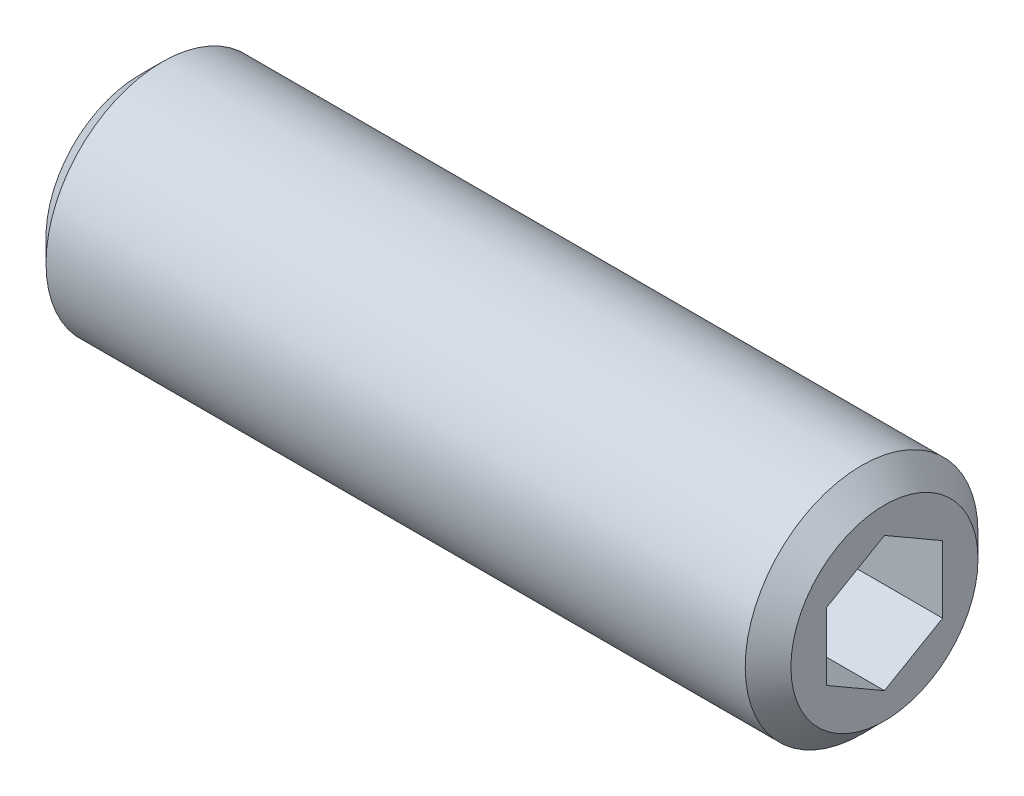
ISO-10303-21;
HEADER;
FILE_DESCRIPTION(('STEP AP214'),'2;1');
FILE_NAME('part.step','',(''),(''),'','','');
FILE_SCHEMA(('AUTOMOTIVE_DESIGN { 1 0 10303 214 1 1 1 1 }'));
ENDSEC;
DATA;
#1=APPLICATION_CONTEXT('core data for automotive mechanical design processes');
#2=APPLICATION_PROTOCOL_DEFINITION('international standard','automotive_design',2000,#1);
#3=PRODUCT_CONTEXT('',#1,'mechanical');
#4=PRODUCT('Part','Part','',(#3));
#5=PRODUCT_RELATED_PRODUCT_CATEGORY('part','',(#4));
#6=PRODUCT_DEFINITION_FORMATION('','',#4);
#7=PRODUCT_DEFINITION_CONTEXT('part definition',#1,'design');
#8=PRODUCT_DEFINITION('design','',#6,#7);
#9=PRODUCT_DEFINITION_SHAPE('','',#8);
#10=(LENGTH_UNIT() NAMED_UNIT(*) SI_UNIT(.MILLI.,.METRE.));
#11=(NAMED_UNIT(*) PLANE_ANGLE_UNIT() SI_UNIT($,.RADIAN.));
#12=(NAMED_UNIT(*) SI_UNIT($,.STERADIAN.) SOLID_ANGLE_UNIT());
#13=UNCERTAINTY_MEASURE_WITH_UNIT(LENGTH_MEASURE(1.E-05),#10,'distance_accuracy_value','');
#14=(GEOMETRIC_REPRESENTATION_CONTEXT(3) GLOBAL_UNCERTAINTY_ASSIGNED_CONTEXT((#13)) GLOBAL_UNIT_ASSIGNED_CONTEXT((#10,
#11,#12)) REPRESENTATION_CONTEXT('',''));
#15=CARTESIAN_POINT('',(0.,0.,0.));
#16=DIRECTION('',(0.,0.,1.));
#17=DIRECTION('',(1.,0.,0.));
#18=AXIS2_PLACEMENT_3D('',#15,#16,#17);
#19=CARTESIAN_POINT('',(16.,-0.721687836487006,-1.25000000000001));
#20=DIRECTION('',(0.,0.,-1.));
#21=DIRECTION('',(-1.,0.,0.));
#22=AXIS2_PLACEMENT_3D('',#19,#20,#21);
#23=PLANE('',#22);
#24=DIRECTION('',(1.,0.,0.));
#25=VECTOR('',#24,1.);
#26=CARTESIAN_POINT('',(16.,-0.72168783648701,-1.25000000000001));
#27=LINE('',#26,#25);
#28=CARTESIAN_POINT('',(13.0000000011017,-0.721687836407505,-1.24999999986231));
#29=VERTEX_POINT('',#28);
#30=CARTESIAN_POINT('',(16.,-0.721687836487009,-1.25000000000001));
#31=VERTEX_POINT('',#30);
#32=EDGE_CURVE('E80',#29,#31,#27,.T.);
#33=ORIENTED_EDGE('',*,*,#32,.T.);
#34=DIRECTION('',(0.,1.,0.));
#35=VECTOR('',#34,1.);
#36=CARTESIAN_POINT('',(16.,-0.721687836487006,-1.25000000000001));
#37=LINE('',#36,#35);
#38=CARTESIAN_POINT('',(16.,0.721687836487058,-1.24999999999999));
#39=VERTEX_POINT('',#38);
#40=EDGE_CURVE('E86',#39,#31,#37,.F.);
#41=ORIENTED_EDGE('',*,*,#40,.F.);
#42=DIRECTION('',(1.,0.,0.));
#43=VECTOR('',#42,1.);
#44=CARTESIAN_POINT('',(16.,0.721687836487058,-1.24999999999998));
#45=LINE('',#44,#43);
#46=CARTESIAN_POINT('',(13.0000000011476,0.721687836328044,-1.25));
#47=VERTEX_POINT('',#46);
#48=EDGE_CURVE('E83',#39,#47,#45,.F.);
#49=ORIENTED_EDGE('',*,*,#48,.T.);
#50=CARTESIAN_POINT('',(13.0000000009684,-0.721687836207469,-1.25000000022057));
#51=CARTESIAN_POINT('',(12.981684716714,-0.658260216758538,-1.25000000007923));
#52=CARTESIAN_POINT('',(12.9650279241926,-0.594285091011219,-1.25000000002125));
#53=CARTESIAN_POINT('',(12.9359539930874,-0.465227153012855,-1.24999999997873));
#54=CARTESIAN_POINT('',(12.923547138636,-0.400142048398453,-1.24999999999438));
#55=CARTESIAN_POINT('',(12.9042349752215,-0.270778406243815,-1.25000000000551));
#56=CARTESIAN_POINT('',(12.8972011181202,-0.206519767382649,-1.25000000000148));
#57=CARTESIAN_POINT('',(12.888805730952,-0.0777002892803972,-1.24999999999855));
#58=CARTESIAN_POINT('',(12.8874372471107,-0.0131399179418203,-1.24999999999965));
#59=CARTESIAN_POINT('',(12.8902914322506,0.107484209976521,-1.25000000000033));
#60=CARTESIAN_POINT('',(12.8938133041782,0.163566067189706,-1.2500000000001));
#61=CARTESIAN_POINT('',(12.904973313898,0.275364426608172,-1.24999999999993));
#62=CARTESIAN_POINT('',(12.9126152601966,0.331080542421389,-1.24999999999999));
#63=CARTESIAN_POINT('',(12.9317186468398,0.443109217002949,-1.25000000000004));
#64=CARTESIAN_POINT('',(12.9432610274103,0.499407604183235,-1.25000000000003));
#65=CARTESIAN_POINT('',(12.9694573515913,0.611164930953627,-1.25));
#66=CARTESIAN_POINT('',(12.984105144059,0.666625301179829,-1.24999999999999));
#67=CARTESIAN_POINT('',(13.0000000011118,0.721687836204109,-1.25000000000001));
#68=B_SPLINE_CURVE_WITH_KNOTS('',3,(#50,#51,#52,#53,#54,#55,#56,#57,#58,#59,#60,#61,#62,#63,#64,
#65,#66,#67),.UNSPECIFIED.,.F.,.F.,(4,2,2,2,2,2,2,2,4),(0.,0.198135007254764,0.396746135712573,
0.590442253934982,0.783900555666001,0.952317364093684,1.1208901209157,1.29320101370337,
1.46517373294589),.UNSPECIFIED.);
#69=EDGE_CURVE('E23',#29,#47,#68,.T.);
#70=ORIENTED_EDGE('',*,*,#69,.F.);
#71=EDGE_LOOP('',(#33,#41,#49,#70));
#72=FACE_BOUND('',#71,.T.);
#73=ADVANCED_FACE('F19',(#72),#23,.F.);
#74=CARTESIAN_POINT('',(16.,-1.44337567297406,0.));
#75=DIRECTION('',(0.,-0.866025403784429,-0.500000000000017));
#76=DIRECTION('',(0.,0.500000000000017,-0.866025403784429));
#77=AXIS2_PLACEMENT_3D('',#74,#75,#76);
#78=PLANE('',#77);
#79=DIRECTION('',(1.,0.,0.));
#80=VECTOR('',#79,1.);
#81=CARTESIAN_POINT('',(16.,-1.44337567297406,0.));
#82=LINE('',#81,#80);
#83=CARTESIAN_POINT('',(13.0000000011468,-1.44337567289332,-1.39871553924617E-10));
#84=VERTEX_POINT('',#83);
#85=CARTESIAN_POINT('',(16.,-1.44337567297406,0.));
#86=VERTEX_POINT('',#85);
#87=EDGE_CURVE('E151',#84,#86,#82,.T.);
#88=ORIENTED_EDGE('',*,*,#87,.T.);
#89=DIRECTION('',(0.,0.500000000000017,-0.866025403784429));
#90=VECTOR('',#89,1.);
#91=CARTESIAN_POINT('',(16.,-1.44337567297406,0.));
#92=LINE('',#91,#90);
#93=EDGE_CURVE('E96',#31,#86,#92,.F.);
#94=ORIENTED_EDGE('',*,*,#93,.F.);
#95=ORIENTED_EDGE('',*,*,#32,.F.);
#96=CARTESIAN_POINT('',(13.000000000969,-1.44337567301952,-3.55461796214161E-10));
#97=CARTESIAN_POINT('',(12.9816847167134,-1.41166186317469,-0.0549299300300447));
#98=CARTESIAN_POINT('',(12.9650279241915,-1.37967430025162,-0.110334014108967));
#99=CARTESIAN_POINT('',(12.9359539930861,-1.31514533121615,-0.222101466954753));
#100=CARTESIAN_POINT('',(12.9235471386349,-1.28260277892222,-0.278466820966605));
#101=CARTESIAN_POINT('',(12.9042349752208,-1.2179209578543,-0.390499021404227));
#102=CARTESIAN_POINT('',(12.8972011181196,-1.18579163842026,-0.446148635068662));
#103=CARTESIAN_POINT('',(12.8888057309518,-1.12138189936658,-0.55770957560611));
#104=CARTESIAN_POINT('',(12.8874372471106,-1.0891017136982,-0.61362049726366));
#105=CARTESIAN_POINT('',(12.8902914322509,-1.02878964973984,-0.718084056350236));
#106=CARTESIAN_POINT('',(12.8938133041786,-1.00074872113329,-0.766652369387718));
#107=CARTESIAN_POINT('',(12.9049733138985,-0.944849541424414,-0.863472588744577));
#108=CARTESIAN_POINT('',(12.9126152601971,-0.91699148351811,-0.911724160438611));
#109=CARTESIAN_POINT('',(12.9317186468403,-0.860977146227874,-1.00874383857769));
#110=CARTESIAN_POINT('',(12.9432610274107,-0.832827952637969,-1.05749967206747));
#111=CARTESIAN_POINT('',(12.9694573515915,-0.776949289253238,-1.15428435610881));
#112=CARTESIAN_POINT('',(12.9841051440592,-0.749219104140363,-1.20231444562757));
#113=CARTESIAN_POINT('',(13.0000000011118,-0.721687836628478,-1.24999999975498));
#114=B_SPLINE_CURVE_WITH_KNOTS('',3,(#96,#97,#98,#99,#100,#101,#102,#103,#104,#105,#106,#107,
#108,#109,#110,#111,#112,#113),.UNSPECIFIED.,.F.,.F.,(4,2,2,2,2,2,2,2,4),(0.,0.198135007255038,
0.396746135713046,0.590442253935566,0.783900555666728,0.952317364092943,1.12089012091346,
1.29320101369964,1.46517373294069),.UNSPECIFIED.);
#115=EDGE_CURVE('E88',#84,#29,#114,.T.);
#116=ORIENTED_EDGE('',*,*,#115,.F.);
#117=EDGE_LOOP('',(#88,#94,#95,#116));
#118=FACE_BOUND('',#117,.T.);
#119=ADVANCED_FACE('F97',(#118),#78,.F.);
#120=CARTESIAN_POINT('',(16.,0.721687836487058,-1.24999999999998));
#121=DIRECTION('',(0.,0.866025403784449,-0.499999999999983));
#122=DIRECTION('',(0.,0.499999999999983,0.866025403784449));
#123=AXIS2_PLACEMENT_3D('',#120,#121,#122);
#124=PLANE('',#123);
#125=ORIENTED_EDGE('',*,*,#48,.F.);
#126=DIRECTION('',(0.,0.499999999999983,0.866025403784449));
#127=VECTOR('',#126,1.);
#128=CARTESIAN_POINT('',(16.,0.721687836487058,-1.24999999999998));
#129=LINE('',#128,#127);
#130=CARTESIAN_POINT('',(16.,1.44337567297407,0.));
#131=VERTEX_POINT('',#130);
#132=EDGE_CURVE('E95',#131,#39,#129,.F.);
#133=ORIENTED_EDGE('',*,*,#132,.F.);
#134=DIRECTION('',(1.,0.,0.));
#135=VECTOR('',#134,1.);
#136=CARTESIAN_POINT('',(16.,1.44337567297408,0.));
#137=LINE('',#136,#135);
#138=CARTESIAN_POINT('',(13.0000000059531,1.44337568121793,1.42788070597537E-08));
#139=VERTEX_POINT('',#138);
#140=EDGE_CURVE('E207',#131,#139,#137,.F.);
#141=ORIENTED_EDGE('',*,*,#140,.T.);
#142=CARTESIAN_POINT('',(13.0000000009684,0.721687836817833,-1.24999999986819));
#143=CARTESIAN_POINT('',(12.9816847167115,0.753401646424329,-1.19507007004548));
#144=CARTESIAN_POINT('',(12.9650279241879,0.785389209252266,-1.13966598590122));
#145=CARTESIAN_POINT('',(12.9359539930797,0.849918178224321,-1.02789853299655));
#146=CARTESIAN_POINT('',(12.9235471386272,0.88246073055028,-0.971533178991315));
#147=CARTESIAN_POINT('',(12.9042349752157,0.947142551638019,-0.859500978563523));
#148=CARTESIAN_POINT('',(12.8972011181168,0.979271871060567,-0.803851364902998));
#149=CARTESIAN_POINT('',(12.8888057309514,1.04368161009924,-0.692290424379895));
#150=CARTESIAN_POINT('',(12.8874372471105,1.07596179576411,-0.636379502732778));
#151=CARTESIAN_POINT('',(12.8902914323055,1.13627386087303,-0.531915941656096));
#152=CARTESIAN_POINT('',(12.8938133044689,1.16431479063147,-0.483347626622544));
#153=CARTESIAN_POINT('',(12.9049733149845,1.2202139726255,-0.386527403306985));
#154=CARTESIAN_POINT('',(12.9126152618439,1.24807203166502,-0.338275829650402));
#155=CARTESIAN_POINT('',(12.9317186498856,1.30408637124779,-0.241256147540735));
#156=CARTESIAN_POINT('',(12.9432610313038,1.33223556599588,-0.192500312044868));
#157=CARTESIAN_POINT('',(12.9694573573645,1.38811423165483,-0.0957156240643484));
#158=CARTESIAN_POINT('',(12.9841051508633,1.4158444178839,-0.0476855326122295));
#159=CARTESIAN_POINT('',(13.0000000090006,1.44337568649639,2.3421380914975E-08));
#160=B_SPLINE_CURVE_WITH_KNOTS('',3,(#142,#143,#144,#145,#146,#147,#148,#149,#150,#151,#152,
#153,#154,#155,#156,#157,#158,#159),.UNSPECIFIED.,.F.,.F.,(4,2,2,2,2,2,2,2,4),(0.,
0.198135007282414,0.396746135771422,0.590442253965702,0.783900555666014,0.952317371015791,
1.12089013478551,1.29320103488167,1.46517376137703),.UNSPECIFIED.);
#161=EDGE_CURVE('E146',#47,#139,#160,.T.);
#162=ORIENTED_EDGE('',*,*,#161,.F.);
#163=EDGE_LOOP('',(#125,#133,#141,#162));
#164=FACE_BOUND('',#163,.T.);
#165=ADVANCED_FACE('F152',(#164),#124,.F.);
#166=CARTESIAN_POINT('',(16.,-0.721687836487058,1.24999999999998));
#167=DIRECTION('',(0.,-0.866025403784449,0.499999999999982));
#168=DIRECTION('',(0.,-0.499999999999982,-0.866025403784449));
#169=AXIS2_PLACEMENT_3D('',#166,#167,#168);
#170=PLANE('',#169);
#171=DIRECTION('',(1.,0.,0.));
#172=VECTOR('',#171,1.);
#173=CARTESIAN_POINT('',(16.,-0.721687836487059,1.25000000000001));
#174=LINE('',#173,#172);
#175=CARTESIAN_POINT('',(12.9999999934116,-0.721687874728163,1.24999996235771));
#176=VERTEX_POINT('',#175);
#177=CARTESIAN_POINT('',(16.,-0.72168783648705,1.25000000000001));
#178=VERTEX_POINT('',#177);
#179=EDGE_CURVE('E204',#176,#178,#174,.T.);
#180=ORIENTED_EDGE('',*,*,#179,.T.);
#181=DIRECTION('',(0.,-0.499999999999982,-0.866025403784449));
#182=VECTOR('',#181,1.);
#183=CARTESIAN_POINT('',(16.,-0.721687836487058,1.24999999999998));
#184=LINE('',#183,#182);
#185=EDGE_CURVE('E211',#86,#178,#184,.F.);
#186=ORIENTED_EDGE('',*,*,#185,.F.);
#187=ORIENTED_EDGE('',*,*,#87,.F.);
#188=CARTESIAN_POINT('',(13.000000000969,-1.44337567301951,3.55409907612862E-10));
#189=CARTESIAN_POINT('',(12.9816847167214,-1.41166186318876,0.0549299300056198));
#190=CARTESIAN_POINT('',(12.9650279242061,-1.37967430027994,0.110334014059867));
#191=CARTESIAN_POINT('',(12.9359539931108,-1.3151453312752,0.222101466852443));
#192=CARTESIAN_POINT('',(12.9235471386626,-1.28260277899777,0.278466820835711));
#193=CARTESIAN_POINT('',(12.9042349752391,-1.21792095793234,0.390499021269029));
#194=CARTESIAN_POINT('',(12.8972011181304,-1.1857916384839,0.446148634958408));
#195=CARTESIAN_POINT('',(12.8888057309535,-1.12138189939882,0.557709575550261));
#196=CARTESIAN_POINT('',(12.8874372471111,-1.08910171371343,0.613620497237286));
#197=CARTESIAN_POINT('',(12.8902914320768,-1.02878965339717,0.718084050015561));
#198=CARTESIAN_POINT('',(12.8938133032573,-1.0007487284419,0.76665235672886));
#199=CARTESIAN_POINT('',(12.904973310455,-0.944849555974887,0.86347256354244));
#200=CARTESIAN_POINT('',(12.912615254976,-0.916991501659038,0.911724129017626));
#201=CARTESIAN_POINT('',(12.9317186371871,-0.860977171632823,1.00874379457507));
#202=CARTESIAN_POINT('',(12.9432610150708,-0.832827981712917,1.05749962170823));
#203=CARTESIAN_POINT('',(12.9694573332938,-0.776949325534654,1.15428429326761));
#204=CARTESIAN_POINT('',(12.984105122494,-0.74921914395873,1.20231437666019));
#205=CARTESIAN_POINT('',(12.9999999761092,-0.721687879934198,1.24999992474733));
#206=B_SPLINE_CURVE_WITH_KNOTS('',3,(#188,#189,#190,#191,#192,#193,#194,#195,#196,#197,#198,
#199,#200,#201,#202,#203,#204,#205),.UNSPECIFIED.,.F.,.F.,(4,2,2,2,2,2,2,2,4),(0.,
0.198135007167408,0.396746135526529,0.590442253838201,0.783900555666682,0.95231734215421,
1.12089007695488,1.29320094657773,1.46517364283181),.UNSPECIFIED.);
#207=EDGE_CURVE('E91',#84,#176,#206,.T.);
#208=ORIENTED_EDGE('',*,*,#207,.T.);
#209=EDGE_LOOP('',(#180,#186,#187,#208));
#210=FACE_BOUND('',#209,.T.);
#211=ADVANCED_FACE('F155',(#210),#170,.F.);
#212=CARTESIAN_POINT('',(16.,1.44337567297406,0.));
#213=DIRECTION('',(0.,0.866025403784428,0.500000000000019));
#214=DIRECTION('',(0.,-0.500000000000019,0.866025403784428));
#215=AXIS2_PLACEMENT_3D('',#212,#213,#214);
#216=PLANE('',#215);
#217=ORIENTED_EDGE('',*,*,#140,.F.);
#218=DIRECTION('',(0.,-0.500000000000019,0.866025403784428));
#219=VECTOR('',#218,1.);
#220=CARTESIAN_POINT('',(16.,1.44337567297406,0.));
#221=LINE('',#220,#219);
#222=CARTESIAN_POINT('',(16.,0.721687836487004,1.25000000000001));
#223=VERTEX_POINT('',#222);
#224=EDGE_CURVE('E43',#223,#131,#221,.F.);
#225=ORIENTED_EDGE('',*,*,#224,.F.);
#226=DIRECTION('',(1.,0.,0.));
#227=VECTOR('',#226,1.);
#228=CARTESIAN_POINT('',(16.,0.721687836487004,1.25000000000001));
#229=LINE('',#228,#227);
#230=CARTESIAN_POINT('',(12.9999999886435,0.72168785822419,1.2499999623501));
#231=VERTEX_POINT('',#230);
#232=EDGE_CURVE('E118',#223,#231,#229,.F.);
#233=ORIENTED_EDGE('',*,*,#232,.T.);
#234=CARTESIAN_POINT('',(12.9999999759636,0.72168788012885,1.2499999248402));
#235=CARTESIAN_POINT('',(12.981684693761,0.75340168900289,1.19506999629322));
#236=CARTESIAN_POINT('',(12.9650279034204,0.785389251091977,1.13966591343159));
#237=CARTESIAN_POINT('',(12.9359539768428,0.849918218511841,1.02789846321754));
#238=CARTESIAN_POINT('',(12.9235471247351,0.882460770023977,0.971533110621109));
#239=CARTESIAN_POINT('',(12.904234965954,0.947142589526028,0.859500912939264));
#240=CARTESIAN_POINT('',(12.8972011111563,0.979271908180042,0.803851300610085));
#241=CARTESIAN_POINT('',(12.8888057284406,1.04368164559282,0.692290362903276));
#242=CARTESIAN_POINT('',(12.8874372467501,1.07596183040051,0.63637944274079));
#243=CARTESIAN_POINT('',(12.8902914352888,1.13627388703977,0.531915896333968));
#244=CARTESIAN_POINT('',(12.8938133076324,1.16431480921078,0.483347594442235));
#245=CARTESIAN_POINT('',(12.9049733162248,1.22021397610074,0.386527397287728));
#246=CARTESIAN_POINT('',(12.9126152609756,1.24807202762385,0.338275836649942));
#247=CARTESIAN_POINT('',(12.9317186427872,1.30408635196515,0.24125618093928));
#248=CARTESIAN_POINT('',(12.9432610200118,1.33223553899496,0.192500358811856));
#249=CARTESIAN_POINT('',(12.9694573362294,1.38811418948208,0.0957156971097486));
#250=CARTESIAN_POINT('',(12.9841051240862,1.41584436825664,0.0476856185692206));
#251=CARTESIAN_POINT('',(12.9999999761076,1.44337562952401,7.52577299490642E-08));
#252=B_SPLINE_CURVE_WITH_KNOTS('',3,(#234,#235,#236,#237,#238,#239,#240,#241,#242,#243,#244,
#245,#246,#247,#248,#249,#250,#251),.UNSPECIFIED.,.F.,.F.,(4,2,2,2,2,2,2,2,4),(0.,
0.198135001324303,0.396746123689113,0.590442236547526,0.783900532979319,0.952317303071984,
1.12089002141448,1.29320087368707,1.46517355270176),.UNSPECIFIED.);
#253=EDGE_CURVE('E142',#231,#139,#252,.T.);
#254=ORIENTED_EDGE('',*,*,#253,.T.);
#255=EDGE_LOOP('',(#217,#225,#233,#254));
#256=FACE_BOUND('',#255,.T.);
#257=ADVANCED_FACE('F130',(#256),#216,.F.);
#258=CARTESIAN_POINT('',(13.0050000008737,0.,0.));
#259=DIRECTION('',(1.,0.,0.));
#260=DIRECTION('',(0.,0.,-1.));
#261=AXIS2_PLACEMENT_3D('',#258,#259,#260);
#262=CONICAL_SURFACE('',#261,1.45203592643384,1.04719754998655);
#263=CARTESIAN_POINT('',(12.1666666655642,-5.6843418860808E-11,0.));
#264=VERTEX_POINT('',#263);
#265=VERTEX_LOOP('',#264);
#266=FACE_BOUND('',#265,.T.);
#267=ORIENTED_EDGE('',*,*,#207,.F.);
#268=ORIENTED_EDGE('',*,*,#115,.T.);
#269=ORIENTED_EDGE('',*,*,#69,.T.);
#270=ORIENTED_EDGE('',*,*,#161,.T.);
#271=ORIENTED_EDGE('',*,*,#253,.F.);
#272=CARTESIAN_POINT('',(13.0000000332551,0.721687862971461,1.24999996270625));
#273=CARTESIAN_POINT('',(12.9816847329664,0.658260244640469,1.24999998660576));
#274=CARTESIAN_POINT('',(12.9650279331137,0.594285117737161,1.24999999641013));
#275=CARTESIAN_POINT('',(12.9359539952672,0.465227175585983,1.25000000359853));
#276=CARTESIAN_POINT('',(12.9235471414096,0.400142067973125,1.25000000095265));
#277=CARTESIAN_POINT('',(12.9042349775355,0.270778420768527,1.24999999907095));
#278=CARTESIAN_POINT('',(12.8972011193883,0.206519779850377,1.24999999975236));
#279=CARTESIAN_POINT('',(12.8888057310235,0.0777002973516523,1.25000000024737));
#280=CARTESIAN_POINT('',(12.8874372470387,0.0131399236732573,1.25000000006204));
#281=CARTESIAN_POINT('',(12.8902914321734,-0.107484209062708,1.24999999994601));
#282=CARTESIAN_POINT('',(12.8938133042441,-0.163566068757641,1.24999999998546));
#283=CARTESIAN_POINT('',(12.9049733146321,-0.27536443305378,1.25000000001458));
#284=CARTESIAN_POINT('',(12.9126152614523,-0.331080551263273,1.25000000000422));
#285=CARTESIAN_POINT('',(12.9317186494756,-0.443109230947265,1.24999999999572));
#286=CARTESIAN_POINT('',(12.9432610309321,-0.499407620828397,1.24999999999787));
#287=CARTESIAN_POINT('',(12.9694573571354,-0.611164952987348,1.25000000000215));
#288=CARTESIAN_POINT('',(12.9841051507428,-0.66662532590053,1.25000000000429));
#289=CARTESIAN_POINT('',(13.0000000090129,-0.721687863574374,1.25000000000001));
#290=B_SPLINE_CURVE_WITH_KNOTS('',3,(#272,#273,#274,#275,#276,#277,#278,#279,#280,#281,#282,
#283,#284,#285,#286,#287,#288,#289),.UNSPECIFIED.,.F.,.F.,(4,2,2,2,2,2,2,2,4),(0.,
0.198135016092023,0.39674615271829,0.590442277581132,0.783900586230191,0.952317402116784,
1.12089016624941,1.29320106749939,1.46517379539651),.UNSPECIFIED.);
#291=EDGE_CURVE('E112',#231,#176,#290,.T.);
#292=ORIENTED_EDGE('',*,*,#291,.T.);
#293=EDGE_LOOP('',(#267,#268,#269,#270,#271,#292));
#294=FACE_BOUND('',#293,.T.);
#295=ADVANCED_FACE('F89',(#266,#294),#262,.F.);
#296=CARTESIAN_POINT('',(16.,0.721687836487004,1.25000000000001));
#297=DIRECTION('',(0.,0.,1.));
#298=DIRECTION('',(1.,0.,0.));
#299=AXIS2_PLACEMENT_3D('',#296,#297,#298);
#300=PLANE('',#299);
#301=ORIENTED_EDGE('',*,*,#232,.F.);
#302=DIRECTION('',(0.,1.,0.));
#303=VECTOR('',#302,1.);
#304=CARTESIAN_POINT('',(16.,0.,1.25000000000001));
#305=LINE('',#304,#303);
#306=EDGE_CURVE('E111',#223,#178,#305,.F.);
#307=ORIENTED_EDGE('',*,*,#306,.T.);
#308=ORIENTED_EDGE('',*,*,#179,.F.);
#309=ORIENTED_EDGE('',*,*,#291,.F.);
#310=EDGE_LOOP('',(#301,#307,#308,#309));
#311=FACE_BOUND('',#310,.T.);
#312=ADVANCED_FACE('F124',(#311),#300,.F.);
#313=CARTESIAN_POINT('',(16.,0.,0.));
#314=DIRECTION('',(-1.,0.,0.));
#315=DIRECTION('',(0.,0.,1.));
#316=AXIS2_PLACEMENT_3D('',#313,#314,#315);
#317=PLANE('',#316);
#318=ORIENTED_EDGE('',*,*,#224,.T.);
#319=ORIENTED_EDGE('',*,*,#132,.T.);
#320=ORIENTED_EDGE('',*,*,#40,.T.);
#321=ORIENTED_EDGE('',*,*,#93,.T.);
#322=ORIENTED_EDGE('',*,*,#185,.T.);
#323=ORIENTED_EDGE('',*,*,#306,.F.);
#324=EDGE_LOOP('',(#318,#319,#320,#321,#322,#323));
#325=FACE_BOUND('',#324,.T.);
#326=CARTESIAN_POINT('',(16.0000000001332,0.,0.));
#327=DIRECTION('',(-1.,0.,0.));
#328=DIRECTION('',(0.,0.,1.));
#329=AXIS2_PLACEMENT_3D('',#326,#327,#328);
#330=CIRCLE('',#329,2.00924000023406);
#331=CARTESIAN_POINT('',(16.0000000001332,0.,2.00924000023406));
#332=VERTEX_POINT('',#331);
#333=EDGE_CURVE('E108',#332,#332,#330,.T.);
#334=ORIENTED_EDGE('',*,*,#333,.F.);
#335=EDGE_LOOP('',(#334));
#336=FACE_BOUND('',#335,.T.);
#337=ADVANCED_FACE('F182',(#325,#336),#317,.F.);
#338=CARTESIAN_POINT('',(0.,1.25,0.));
#339=DIRECTION('',(-1.,0.,0.));
#340=DIRECTION('',(0.,0.,1.));
#341=AXIS2_PLACEMENT_3D('',#338,#339,#340);
#342=PLANE('',#341);
#343=CARTESIAN_POINT('',(-2.27373783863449E-10,0.,0.));
#344=DIRECTION('',(1.,0.,0.));
#345=DIRECTION('',(0.,1.,0.));
#346=AXIS2_PLACEMENT_3D('',#343,#344,#345);
#347=CIRCLE('',#346,2.00924000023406);
#348=CARTESIAN_POINT('',(-2.27373871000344E-10,2.00924000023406,0.));
#349=VERTEX_POINT('',#348);
#350=EDGE_CURVE('E104',#349,#349,#347,.T.);
#351=ORIENTED_EDGE('',*,*,#350,.F.);
#352=EDGE_LOOP('',(#351));
#353=FACE_BOUND('',#352,.T.);
#354=ADVANCED_FACE('F179',(#353),#342,.T.);
#355=CARTESIAN_POINT('',(15.5092399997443,0.,0.));
#356=DIRECTION('',(-1.,0.,0.));
#357=DIRECTION('',(0.,0.,1.));
#358=AXIS2_PLACEMENT_3D('',#355,#356,#357);
#359=CONICAL_SURFACE('',#358,2.49999999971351,0.78539816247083);
#360=ORIENTED_EDGE('',*,*,#333,.T.);
#361=EDGE_LOOP('',(#360));
#362=FACE_BOUND('',#361,.T.);
#363=CARTESIAN_POINT('',(15.50924,0.,0.));
#364=DIRECTION('',(1.,0.,0.));
#365=DIRECTION('',(0.,1.,0.));
#366=AXIS2_PLACEMENT_3D('',#363,#364,#365);
#367=CIRCLE('',#366,2.5);
#368=CARTESIAN_POINT('',(15.50924,2.5,0.));
#369=VERTEX_POINT('',#368);
#370=EDGE_CURVE('E34',#369,#369,#367,.F.);
#371=ORIENTED_EDGE('',*,*,#370,.F.);
#372=EDGE_LOOP('',(#371));
#373=FACE_BOUND('',#372,.T.);
#374=ADVANCED_FACE('F172',(#362,#373),#359,.T.);
#375=CARTESIAN_POINT('',(0.490760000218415,0.,0.));
#376=DIRECTION('',(1.,0.,0.));
#377=DIRECTION('',(0.,1.,0.));
#378=AXIS2_PLACEMENT_3D('',#375,#376,#377);
#379=CONICAL_SURFACE('',#378,2.49999999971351,0.785398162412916);
#380=CARTESIAN_POINT('',(0.49076,0.,0.));
#381=DIRECTION('',(1.,0.,0.));
#382=DIRECTION('',(0.,1.,0.));
#383=AXIS2_PLACEMENT_3D('',#380,#381,#382);
#384=CIRCLE('',#383,2.5);
#385=CARTESIAN_POINT('',(0.49076,2.5,0.));
#386=VERTEX_POINT('',#385);
#387=EDGE_CURVE('E11',#386,#386,#384,.T.);
#388=ORIENTED_EDGE('',*,*,#387,.F.);
#389=EDGE_LOOP('',(#388));
#390=FACE_BOUND('',#389,.T.);
#391=ORIENTED_EDGE('',*,*,#350,.T.);
#392=EDGE_LOOP('',(#391));
#393=FACE_BOUND('',#392,.T.);
#394=ADVANCED_FACE('F166',(#390,#393),#379,.T.);
#395=CARTESIAN_POINT('',(8.,0.,0.));
#396=DIRECTION('',(1.,0.,0.));
#397=DIRECTION('',(0.,1.,0.));
#398=AXIS2_PLACEMENT_3D('',#395,#396,#397);
#399=CYLINDRICAL_SURFACE('',#398,2.5);
#400=ORIENTED_EDGE('',*,*,#387,.T.);
#401=EDGE_LOOP('',(#400));
#402=FACE_BOUND('',#401,.T.);
#403=ORIENTED_EDGE('',*,*,#370,.T.);
#404=EDGE_LOOP('',(#403));
#405=FACE_BOUND('',#404,.T.);
#406=ADVANCED_FACE('F164',(#402,#405),#399,.T.);
#407=CLOSED_SHELL('',(#73,#119,#165,#211,#257,#295,#312,#337,#354,#374,#394,#406));
#408=MANIFOLD_SOLID_BREP('B1',#407);
#409=ADVANCED_BREP_SHAPE_REPRESENTATION('',(#18,#408),#14);
#410=SHAPE_DEFINITION_REPRESENTATION(#9,#409);
ENDSEC;
END-ISO-10303-21;
